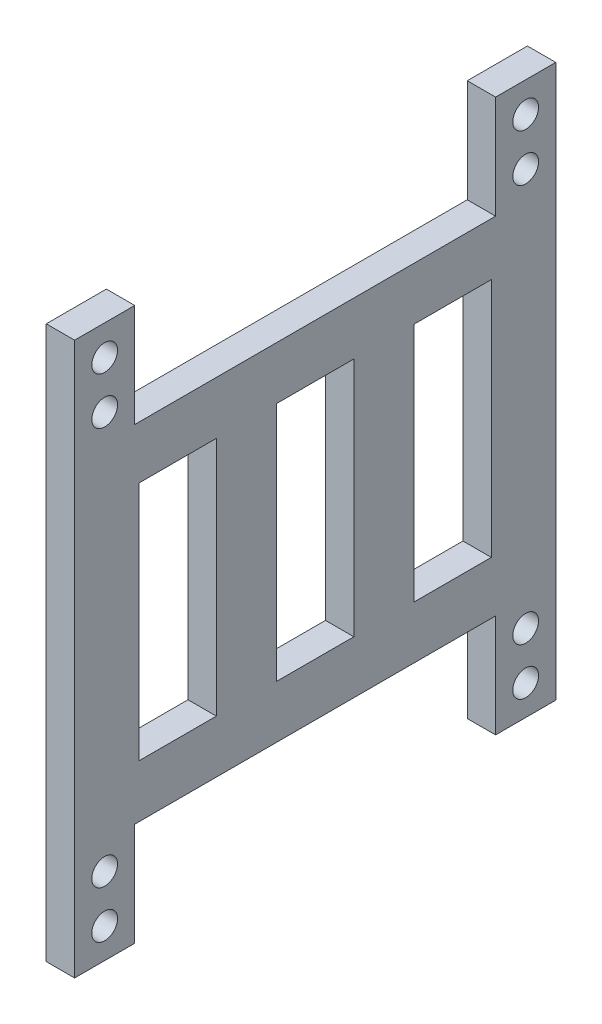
ISO-10303-21;
HEADER;
FILE_DESCRIPTION(('STEP AP214'),'2;1');
FILE_NAME('part.step','',(''),(''),'','','');
FILE_SCHEMA(('AUTOMOTIVE_DESIGN { 1 0 10303 214 1 1 1 1 }'));
ENDSEC;
DATA;
#1=APPLICATION_CONTEXT('core data for automotive mechanical design processes');
#2=APPLICATION_PROTOCOL_DEFINITION('international standard','automotive_design',2000,#1);
#3=PRODUCT_CONTEXT('',#1,'mechanical');
#4=PRODUCT('Part','Part','',(#3));
#5=PRODUCT_RELATED_PRODUCT_CATEGORY('part','',(#4));
#6=PRODUCT_DEFINITION_FORMATION('','',#4);
#7=PRODUCT_DEFINITION_CONTEXT('part definition',#1,'design');
#8=PRODUCT_DEFINITION('design','',#6,#7);
#9=PRODUCT_DEFINITION_SHAPE('','',#8);
#10=(LENGTH_UNIT() NAMED_UNIT(*) SI_UNIT(.MILLI.,.METRE.));
#11=(NAMED_UNIT(*) PLANE_ANGLE_UNIT() SI_UNIT($,.RADIAN.));
#12=(NAMED_UNIT(*) SI_UNIT($,.STERADIAN.) SOLID_ANGLE_UNIT());
#13=UNCERTAINTY_MEASURE_WITH_UNIT(LENGTH_MEASURE(1.E-05),#10,'distance_accuracy_value','');
#14=(GEOMETRIC_REPRESENTATION_CONTEXT(3) GLOBAL_UNCERTAINTY_ASSIGNED_CONTEXT((#13)) GLOBAL_UNIT_ASSIGNED_CONTEXT((#10,
#11,#12)) REPRESENTATION_CONTEXT('',''));
#15=CARTESIAN_POINT('',(0.,0.,0.));
#16=DIRECTION('',(0.,0.,1.));
#17=DIRECTION('',(1.,0.,0.));
#18=AXIS2_PLACEMENT_3D('',#15,#16,#17);
#19=CARTESIAN_POINT('',(3.3,-20.145,0.));
#20=DIRECTION('',(0.,1.,0.));
#21=DIRECTION('',(0.,0.,1.));
#22=AXIS2_PLACEMENT_3D('',#19,#20,#21);
#23=PLANE('',#22);
#24=DIRECTION('',(0.,0.,-1.));
#25=VECTOR('',#24,1.);
#26=CARTESIAN_POINT('',(0.,-20.145,0.));
#27=LINE('',#26,#25);
#28=CARTESIAN_POINT('',(0.,-20.145,21.));
#29=VERTEX_POINT('',#28);
#30=CARTESIAN_POINT('',(0.,-20.145,-21.));
#31=VERTEX_POINT('',#30);
#32=EDGE_CURVE('E264',#29,#31,#27,.T.);
#33=ORIENTED_EDGE('',*,*,#32,.T.);
#34=DIRECTION('',(-1.,0.,0.));
#35=VECTOR('',#34,1.);
#36=CARTESIAN_POINT('',(3.3,-20.145,-21.));
#37=LINE('',#36,#35);
#38=CARTESIAN_POINT('',(3.3,-20.145,-21.));
#39=VERTEX_POINT('',#38);
#40=EDGE_CURVE('E407',#39,#31,#37,.T.);
#41=ORIENTED_EDGE('',*,*,#40,.F.);
#42=DIRECTION('',(0.,0.,-1.));
#43=VECTOR('',#42,1.);
#44=CARTESIAN_POINT('',(3.3,-20.145,0.));
#45=LINE('',#44,#43);
#46=CARTESIAN_POINT('',(3.3,-20.145,21.));
#47=VERTEX_POINT('',#46);
#48=EDGE_CURVE('E271',#47,#39,#45,.T.);
#49=ORIENTED_EDGE('',*,*,#48,.F.);
#50=DIRECTION('',(-1.,0.,0.));
#51=VECTOR('',#50,1.);
#52=CARTESIAN_POINT('',(3.3,-20.145,21.));
#53=LINE('',#52,#51);
#54=EDGE_CURVE('E327',#47,#29,#53,.T.);
#55=ORIENTED_EDGE('',*,*,#54,.T.);
#56=EDGE_LOOP('',(#33,#41,#49,#55));
#57=FACE_BOUND('',#56,.T.);
#58=ADVANCED_FACE('F39',(#57),#23,.F.);
#59=CARTESIAN_POINT('',(3.3,0.,-21.));
#60=DIRECTION('',(0.,0.,-1.));
#61=DIRECTION('',(-1.,0.,0.));
#62=AXIS2_PLACEMENT_3D('',#59,#60,#61);
#63=PLANE('',#62);
#64=DIRECTION('',(0.,-1.,0.));
#65=VECTOR('',#64,1.);
#66=CARTESIAN_POINT('',(0.,0.,-21.));
#67=LINE('',#66,#65);
#68=CARTESIAN_POINT('',(0.,-32.145,-21.));
#69=VERTEX_POINT('',#68);
#70=EDGE_CURVE('E330',#31,#69,#67,.T.);
#71=ORIENTED_EDGE('',*,*,#70,.T.);
#72=DIRECTION('',(-1.,0.,0.));
#73=VECTOR('',#72,1.);
#74=CARTESIAN_POINT('',(3.3,-32.145,-21.));
#75=LINE('',#74,#73);
#76=CARTESIAN_POINT('',(3.3,-32.145,-21.));
#77=VERTEX_POINT('',#76);
#78=EDGE_CURVE('E405',#77,#69,#75,.T.);
#79=ORIENTED_EDGE('',*,*,#78,.F.);
#80=DIRECTION('',(0.,-1.,0.));
#81=VECTOR('',#80,1.);
#82=CARTESIAN_POINT('',(3.3,0.,-21.));
#83=LINE('',#82,#81);
#84=EDGE_CURVE('E274',#39,#77,#83,.T.);
#85=ORIENTED_EDGE('',*,*,#84,.F.);
#86=ORIENTED_EDGE('',*,*,#40,.T.);
#87=EDGE_LOOP('',(#71,#79,#85,#86));
#88=FACE_BOUND('',#87,.T.);
#89=ADVANCED_FACE('F465',(#88),#63,.F.);
#90=CARTESIAN_POINT('',(3.3,-32.145,0.));
#91=DIRECTION('',(0.,-1.,0.));
#92=DIRECTION('',(0.,0.,-1.));
#93=AXIS2_PLACEMENT_3D('',#90,#91,#92);
#94=PLANE('',#93);
#95=DIRECTION('',(0.,0.,1.));
#96=VECTOR('',#95,1.);
#97=CARTESIAN_POINT('',(0.,-32.145,0.));
#98=LINE('',#97,#96);
#99=CARTESIAN_POINT('',(0.,-32.145,-28.));
#100=VERTEX_POINT('',#99);
#101=EDGE_CURVE('E333',#100,#69,#98,.T.);
#102=ORIENTED_EDGE('',*,*,#101,.F.);
#103=DIRECTION('',(-1.,0.,0.));
#104=VECTOR('',#103,1.);
#105=CARTESIAN_POINT('',(3.3,-32.145,-28.));
#106=LINE('',#105,#104);
#107=CARTESIAN_POINT('',(3.3,-32.145,-28.));
#108=VERTEX_POINT('',#107);
#109=EDGE_CURVE('E403',#108,#100,#106,.T.);
#110=ORIENTED_EDGE('',*,*,#109,.F.);
#111=DIRECTION('',(0.,0.,1.));
#112=VECTOR('',#111,1.);
#113=CARTESIAN_POINT('',(3.3,-32.145,0.));
#114=LINE('',#113,#112);
#115=EDGE_CURVE('E277',#108,#77,#114,.T.);
#116=ORIENTED_EDGE('',*,*,#115,.T.);
#117=ORIENTED_EDGE('',*,*,#78,.T.);
#118=EDGE_LOOP('',(#102,#110,#116,#117));
#119=FACE_BOUND('',#118,.T.);
#120=ADVANCED_FACE('F470',(#119),#94,.T.);
#121=CARTESIAN_POINT('',(3.3,0.,-28.));
#122=DIRECTION('',(0.,0.,1.));
#123=DIRECTION('',(1.,0.,0.));
#124=AXIS2_PLACEMENT_3D('',#121,#122,#123);
#125=PLANE('',#124);
#126=DIRECTION('',(0.,1.,0.));
#127=VECTOR('',#126,1.);
#128=CARTESIAN_POINT('',(0.,0.,-28.));
#129=LINE('',#128,#127);
#130=CARTESIAN_POINT('',(0.,32.145,-28.));
#131=VERTEX_POINT('',#130);
#132=EDGE_CURVE('E336',#100,#131,#129,.T.);
#133=ORIENTED_EDGE('',*,*,#132,.T.);
#134=DIRECTION('',(-1.,0.,0.));
#135=VECTOR('',#134,1.);
#136=CARTESIAN_POINT('',(3.3,32.145,-28.));
#137=LINE('',#136,#135);
#138=CARTESIAN_POINT('',(3.3,32.145,-28.));
#139=VERTEX_POINT('',#138);
#140=EDGE_CURVE('E400',#139,#131,#137,.T.);
#141=ORIENTED_EDGE('',*,*,#140,.F.);
#142=DIRECTION('',(0.,1.,0.));
#143=VECTOR('',#142,1.);
#144=CARTESIAN_POINT('',(3.3,0.,-28.));
#145=LINE('',#144,#143);
#146=EDGE_CURVE('E280',#108,#139,#145,.T.);
#147=ORIENTED_EDGE('',*,*,#146,.F.);
#148=ORIENTED_EDGE('',*,*,#109,.T.);
#149=EDGE_LOOP('',(#133,#141,#147,#148));
#150=FACE_BOUND('',#149,.T.);
#151=ADVANCED_FACE('F516',(#150),#125,.F.);
#152=CARTESIAN_POINT('',(3.3,32.145,0.));
#153=DIRECTION('',(0.,-1.,0.));
#154=DIRECTION('',(0.,0.,-1.));
#155=AXIS2_PLACEMENT_3D('',#152,#153,#154);
#156=PLANE('',#155);
#157=DIRECTION('',(0.,0.,1.));
#158=VECTOR('',#157,1.);
#159=CARTESIAN_POINT('',(0.,32.145,0.));
#160=LINE('',#159,#158);
#161=CARTESIAN_POINT('',(0.,32.145,-21.));
#162=VERTEX_POINT('',#161);
#163=EDGE_CURVE('E338',#131,#162,#160,.T.);
#164=ORIENTED_EDGE('',*,*,#163,.T.);
#165=DIRECTION('',(-1.,0.,0.));
#166=VECTOR('',#165,1.);
#167=CARTESIAN_POINT('',(3.3,32.145,-21.));
#168=LINE('',#167,#166);
#169=CARTESIAN_POINT('',(3.3,32.145,-21.));
#170=VERTEX_POINT('',#169);
#171=EDGE_CURVE('E398',#170,#162,#168,.T.);
#172=ORIENTED_EDGE('',*,*,#171,.F.);
#173=DIRECTION('',(0.,0.,1.));
#174=VECTOR('',#173,1.);
#175=CARTESIAN_POINT('',(3.3,32.145,0.));
#176=LINE('',#175,#174);
#177=EDGE_CURVE('E282',#139,#170,#176,.T.);
#178=ORIENTED_EDGE('',*,*,#177,.F.);
#179=ORIENTED_EDGE('',*,*,#140,.T.);
#180=EDGE_LOOP('',(#164,#172,#178,#179));
#181=FACE_BOUND('',#180,.T.);
#182=ADVANCED_FACE('F511',(#181),#156,.F.);
#183=CARTESIAN_POINT('',(3.3,0.,-21.));
#184=DIRECTION('',(0.,0.,1.));
#185=DIRECTION('',(1.,0.,0.));
#186=AXIS2_PLACEMENT_3D('',#183,#184,#185);
#187=PLANE('',#186);
#188=DIRECTION('',(0.,1.,0.));
#189=VECTOR('',#188,1.);
#190=CARTESIAN_POINT('',(0.,0.,-21.));
#191=LINE('',#190,#189);
#192=CARTESIAN_POINT('',(0.,20.145,-21.));
#193=VERTEX_POINT('',#192);
#194=EDGE_CURVE('E341',#193,#162,#191,.T.);
#195=ORIENTED_EDGE('',*,*,#194,.F.);
#196=DIRECTION('',(-1.,0.,0.));
#197=VECTOR('',#196,1.);
#198=CARTESIAN_POINT('',(3.3,20.145,-21.));
#199=LINE('',#198,#197);
#200=CARTESIAN_POINT('',(3.3,20.145,-21.));
#201=VERTEX_POINT('',#200);
#202=EDGE_CURVE('E396',#201,#193,#199,.T.);
#203=ORIENTED_EDGE('',*,*,#202,.F.);
#204=DIRECTION('',(0.,1.,0.));
#205=VECTOR('',#204,1.);
#206=CARTESIAN_POINT('',(3.3,0.,-21.));
#207=LINE('',#206,#205);
#208=EDGE_CURVE('E284',#201,#170,#207,.T.);
#209=ORIENTED_EDGE('',*,*,#208,.T.);
#210=ORIENTED_EDGE('',*,*,#171,.T.);
#211=EDGE_LOOP('',(#195,#203,#209,#210));
#212=FACE_BOUND('',#211,.T.);
#213=ADVANCED_FACE('F505',(#212),#187,.T.);
#214=CARTESIAN_POINT('',(3.3,20.145,0.));
#215=DIRECTION('',(0.,1.,0.));
#216=DIRECTION('',(0.,0.,1.));
#217=AXIS2_PLACEMENT_3D('',#214,#215,#216);
#218=PLANE('',#217);
#219=DIRECTION('',(0.,0.,-1.));
#220=VECTOR('',#219,1.);
#221=CARTESIAN_POINT('',(0.,20.145,0.));
#222=LINE('',#221,#220);
#223=CARTESIAN_POINT('',(0.,20.145,21.));
#224=VERTEX_POINT('',#223);
#225=EDGE_CURVE('E344',#224,#193,#222,.T.);
#226=ORIENTED_EDGE('',*,*,#225,.F.);
#227=DIRECTION('',(-1.,0.,0.));
#228=VECTOR('',#227,1.);
#229=CARTESIAN_POINT('',(3.3,20.145,21.));
#230=LINE('',#229,#228);
#231=CARTESIAN_POINT('',(3.3,20.145,21.));
#232=VERTEX_POINT('',#231);
#233=EDGE_CURVE('E394',#232,#224,#230,.T.);
#234=ORIENTED_EDGE('',*,*,#233,.F.);
#235=DIRECTION('',(0.,0.,-1.));
#236=VECTOR('',#235,1.);
#237=CARTESIAN_POINT('',(3.3,20.145,0.));
#238=LINE('',#237,#236);
#239=EDGE_CURVE('E287',#232,#201,#238,.T.);
#240=ORIENTED_EDGE('',*,*,#239,.T.);
#241=ORIENTED_EDGE('',*,*,#202,.T.);
#242=EDGE_LOOP('',(#226,#234,#240,#241));
#243=FACE_BOUND('',#242,.T.);
#244=ADVANCED_FACE('F499',(#243),#218,.T.);
#245=CARTESIAN_POINT('',(3.3,0.,21.));
#246=DIRECTION('',(0.,0.,1.));
#247=DIRECTION('',(1.,0.,0.));
#248=AXIS2_PLACEMENT_3D('',#245,#246,#247);
#249=PLANE('',#248);
#250=DIRECTION('',(0.,1.,0.));
#251=VECTOR('',#250,1.);
#252=CARTESIAN_POINT('',(0.,0.,21.));
#253=LINE('',#252,#251);
#254=CARTESIAN_POINT('',(0.,32.145,21.));
#255=VERTEX_POINT('',#254);
#256=EDGE_CURVE('E347',#224,#255,#253,.T.);
#257=ORIENTED_EDGE('',*,*,#256,.T.);
#258=DIRECTION('',(-1.,0.,0.));
#259=VECTOR('',#258,1.);
#260=CARTESIAN_POINT('',(3.3,32.145,21.));
#261=LINE('',#260,#259);
#262=CARTESIAN_POINT('',(3.3,32.145,21.));
#263=VERTEX_POINT('',#262);
#264=EDGE_CURVE('E392',#263,#255,#261,.T.);
#265=ORIENTED_EDGE('',*,*,#264,.F.);
#266=DIRECTION('',(0.,1.,0.));
#267=VECTOR('',#266,1.);
#268=CARTESIAN_POINT('',(3.3,0.,21.));
#269=LINE('',#268,#267);
#270=EDGE_CURVE('E290',#232,#263,#269,.T.);
#271=ORIENTED_EDGE('',*,*,#270,.F.);
#272=ORIENTED_EDGE('',*,*,#233,.T.);
#273=EDGE_LOOP('',(#257,#265,#271,#272));
#274=FACE_BOUND('',#273,.T.);
#275=ADVANCED_FACE('F522',(#274),#249,.F.);
#276=CARTESIAN_POINT('',(3.3,32.145,0.));
#277=DIRECTION('',(0.,1.,0.));
#278=DIRECTION('',(0.,0.,1.));
#279=AXIS2_PLACEMENT_3D('',#276,#277,#278);
#280=PLANE('',#279);
#281=DIRECTION('',(0.,0.,-1.));
#282=VECTOR('',#281,1.);
#283=CARTESIAN_POINT('',(0.,32.145,0.));
#284=LINE('',#283,#282);
#285=CARTESIAN_POINT('',(0.,32.145,28.));
#286=VERTEX_POINT('',#285);
#287=EDGE_CURVE('E350',#286,#255,#284,.T.);
#288=ORIENTED_EDGE('',*,*,#287,.F.);
#289=DIRECTION('',(-1.,0.,0.));
#290=VECTOR('',#289,1.);
#291=CARTESIAN_POINT('',(3.3,32.145,28.));
#292=LINE('',#291,#290);
#293=CARTESIAN_POINT('',(3.3,32.145,28.));
#294=VERTEX_POINT('',#293);
#295=EDGE_CURVE('E390',#294,#286,#292,.T.);
#296=ORIENTED_EDGE('',*,*,#295,.F.);
#297=DIRECTION('',(0.,0.,-1.));
#298=VECTOR('',#297,1.);
#299=CARTESIAN_POINT('',(3.3,32.145,0.));
#300=LINE('',#299,#298);
#301=EDGE_CURVE('E292',#294,#263,#300,.T.);
#302=ORIENTED_EDGE('',*,*,#301,.T.);
#303=ORIENTED_EDGE('',*,*,#264,.T.);
#304=EDGE_LOOP('',(#288,#296,#302,#303));
#305=FACE_BOUND('',#304,.T.);
#306=ADVANCED_FACE('F493',(#305),#280,.T.);
#307=CARTESIAN_POINT('',(3.3,0.,28.));
#308=DIRECTION('',(0.,0.,1.));
#309=DIRECTION('',(0.,-1.,0.));
#310=AXIS2_PLACEMENT_3D('',#307,#308,#309);
#311=PLANE('',#310);
#312=DIRECTION('',(0.,1.,0.));
#313=VECTOR('',#312,1.);
#314=CARTESIAN_POINT('',(0.,0.,28.));
#315=LINE('',#314,#313);
#316=CARTESIAN_POINT('',(0.,-32.145,28.));
#317=VERTEX_POINT('',#316);
#318=EDGE_CURVE('E353',#317,#286,#315,.T.);
#319=ORIENTED_EDGE('',*,*,#318,.F.);
#320=DIRECTION('',(-1.,0.,0.));
#321=VECTOR('',#320,1.);
#322=CARTESIAN_POINT('',(3.3,-32.145,28.));
#323=LINE('',#322,#321);
#324=CARTESIAN_POINT('',(3.3,-32.145,28.));
#325=VERTEX_POINT('',#324);
#326=EDGE_CURVE('E388',#325,#317,#323,.T.);
#327=ORIENTED_EDGE('',*,*,#326,.F.);
#328=DIRECTION('',(0.,1.,0.));
#329=VECTOR('',#328,1.);
#330=CARTESIAN_POINT('',(3.3,0.,28.));
#331=LINE('',#330,#329);
#332=EDGE_CURVE('E295',#325,#294,#331,.T.);
#333=ORIENTED_EDGE('',*,*,#332,.T.);
#334=ORIENTED_EDGE('',*,*,#295,.T.);
#335=EDGE_LOOP('',(#319,#327,#333,#334));
#336=FACE_BOUND('',#335,.T.);
#337=ADVANCED_FACE('F488',(#336),#311,.T.);
#338=CARTESIAN_POINT('',(3.3,-32.1450000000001,0.));
#339=DIRECTION('',(0.,1.,0.));
#340=DIRECTION('',(0.,0.,1.));
#341=AXIS2_PLACEMENT_3D('',#338,#339,#340);
#342=PLANE('',#341);
#343=DIRECTION('',(0.,0.,-1.));
#344=VECTOR('',#343,1.);
#345=CARTESIAN_POINT('',(0.,-32.1450000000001,0.));
#346=LINE('',#345,#344);
#347=CARTESIAN_POINT('',(0.,-32.145,21.));
#348=VERTEX_POINT('',#347);
#349=EDGE_CURVE('E356',#317,#348,#346,.T.);
#350=ORIENTED_EDGE('',*,*,#349,.T.);
#351=DIRECTION('',(-1.,0.,0.));
#352=VECTOR('',#351,1.);
#353=CARTESIAN_POINT('',(3.3,-32.145,21.));
#354=LINE('',#353,#352);
#355=CARTESIAN_POINT('',(3.3,-32.145,21.));
#356=VERTEX_POINT('',#355);
#357=EDGE_CURVE('E386',#356,#348,#354,.T.);
#358=ORIENTED_EDGE('',*,*,#357,.F.);
#359=DIRECTION('',(0.,0.,-1.));
#360=VECTOR('',#359,1.);
#361=CARTESIAN_POINT('',(3.3,-32.1450000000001,0.));
#362=LINE('',#361,#360);
#363=EDGE_CURVE('E298',#325,#356,#362,.T.);
#364=ORIENTED_EDGE('',*,*,#363,.F.);
#365=ORIENTED_EDGE('',*,*,#326,.T.);
#366=EDGE_LOOP('',(#350,#358,#364,#365));
#367=FACE_BOUND('',#366,.T.);
#368=ADVANCED_FACE('F485',(#367),#342,.F.);
#369=CARTESIAN_POINT('',(3.3,-28.645,-24.5));
#370=DIRECTION('',(-1.,0.,0.));
#371=DIRECTION('',(0.,0.,1.));
#372=AXIS2_PLACEMENT_3D('',#369,#370,#371);
#373=CYLINDRICAL_SURFACE('',#372,1.5);
#374=CARTESIAN_POINT('',(3.3,-28.645,-24.5));
#375=DIRECTION('',(1.,0.,0.));
#376=DIRECTION('',(0.,0.,-1.));
#377=AXIS2_PLACEMENT_3D('',#374,#375,#376);
#378=CIRCLE('',#377,1.5);
#379=CARTESIAN_POINT('',(3.3,-28.645,-26.));
#380=VERTEX_POINT('',#379);
#381=EDGE_CURVE('E321',#380,#380,#378,.T.);
#382=ORIENTED_EDGE('',*,*,#381,.T.);
#383=EDGE_LOOP('',(#382));
#384=FACE_BOUND('',#383,.T.);
#385=CARTESIAN_POINT('',(0.,-28.645,-24.5));
#386=DIRECTION('',(1.,0.,0.));
#387=DIRECTION('',(0.,0.,-1.));
#388=AXIS2_PLACEMENT_3D('',#385,#386,#387);
#389=CIRCLE('',#388,1.5);
#390=CARTESIAN_POINT('',(0.,-28.645,-26.));
#391=VERTEX_POINT('',#390);
#392=EDGE_CURVE('E380',#391,#391,#389,.T.);
#393=ORIENTED_EDGE('',*,*,#392,.F.);
#394=EDGE_LOOP('',(#393));
#395=FACE_BOUND('',#394,.T.);
#396=ADVANCED_FACE('F589',(#384,#395),#373,.F.);
#397=CARTESIAN_POINT('',(3.3,-28.645,24.5));
#398=DIRECTION('',(-1.,0.,0.));
#399=DIRECTION('',(0.,0.,1.));
#400=AXIS2_PLACEMENT_3D('',#397,#398,#399);
#401=CYLINDRICAL_SURFACE('',#400,1.5);
#402=CARTESIAN_POINT('',(3.3,-28.645,24.5));
#403=DIRECTION('',(1.,0.,0.));
#404=DIRECTION('',(0.,0.,-1.));
#405=AXIS2_PLACEMENT_3D('',#402,#403,#404);
#406=CIRCLE('',#405,1.5);
#407=CARTESIAN_POINT('',(3.3,-28.645,23.));
#408=VERTEX_POINT('',#407);
#409=EDGE_CURVE('E318',#408,#408,#406,.F.);
#410=ORIENTED_EDGE('',*,*,#409,.F.);
#411=EDGE_LOOP('',(#410));
#412=FACE_BOUND('',#411,.T.);
#413=CARTESIAN_POINT('',(0.,-28.645,24.5));
#414=DIRECTION('',(1.,0.,0.));
#415=DIRECTION('',(0.,0.,-1.));
#416=AXIS2_PLACEMENT_3D('',#413,#414,#415);
#417=CIRCLE('',#416,1.5);
#418=CARTESIAN_POINT('',(0.,-28.645,23.));
#419=VERTEX_POINT('',#418);
#420=EDGE_CURVE('E377',#419,#419,#417,.F.);
#421=ORIENTED_EDGE('',*,*,#420,.T.);
#422=EDGE_LOOP('',(#421));
#423=FACE_BOUND('',#422,.T.);
#424=ADVANCED_FACE('F598',(#412,#423),#401,.F.);
#425=CARTESIAN_POINT('',(3.3,-23.145,24.5));
#426=DIRECTION('',(-1.,0.,0.));
#427=DIRECTION('',(0.,0.,1.));
#428=AXIS2_PLACEMENT_3D('',#425,#426,#427);
#429=CYLINDRICAL_SURFACE('',#428,1.5);
#430=CARTESIAN_POINT('',(3.3,-23.145,24.5));
#431=DIRECTION('',(1.,0.,0.));
#432=DIRECTION('',(0.,0.,-1.));
#433=AXIS2_PLACEMENT_3D('',#430,#431,#432);
#434=CIRCLE('',#433,1.5);
#435=CARTESIAN_POINT('',(3.3,-23.145,23.));
#436=VERTEX_POINT('',#435);
#437=EDGE_CURVE('E315',#436,#436,#434,.F.);
#438=ORIENTED_EDGE('',*,*,#437,.F.);
#439=EDGE_LOOP('',(#438));
#440=FACE_BOUND('',#439,.T.);
#441=CARTESIAN_POINT('',(0.,-23.145,24.5));
#442=DIRECTION('',(1.,0.,0.));
#443=DIRECTION('',(0.,0.,-1.));
#444=AXIS2_PLACEMENT_3D('',#441,#442,#443);
#445=CIRCLE('',#444,1.5);
#446=CARTESIAN_POINT('',(0.,-23.145,23.));
#447=VERTEX_POINT('',#446);
#448=EDGE_CURVE('E374',#447,#447,#445,.F.);
#449=ORIENTED_EDGE('',*,*,#448,.T.);
#450=EDGE_LOOP('',(#449));
#451=FACE_BOUND('',#450,.T.);
#452=ADVANCED_FACE('F608',(#440,#451),#429,.F.);
#453=CARTESIAN_POINT('',(3.3,28.645,-24.5));
#454=DIRECTION('',(-1.,0.,0.));
#455=DIRECTION('',(0.,0.,1.));
#456=AXIS2_PLACEMENT_3D('',#453,#454,#455);
#457=CYLINDRICAL_SURFACE('',#456,1.5);
#458=CARTESIAN_POINT('',(3.3,28.645,-24.5));
#459=DIRECTION('',(1.,0.,0.));
#460=DIRECTION('',(0.,0.,-1.));
#461=AXIS2_PLACEMENT_3D('',#458,#459,#460);
#462=CIRCLE('',#461,1.5);
#463=CARTESIAN_POINT('',(3.3,28.645,-26.));
#464=VERTEX_POINT('',#463);
#465=EDGE_CURVE('E312',#464,#464,#462,.F.);
#466=ORIENTED_EDGE('',*,*,#465,.F.);
#467=EDGE_LOOP('',(#466));
#468=FACE_BOUND('',#467,.T.);
#469=CARTESIAN_POINT('',(0.,28.645,-24.5));
#470=DIRECTION('',(1.,0.,0.));
#471=DIRECTION('',(0.,0.,-1.));
#472=AXIS2_PLACEMENT_3D('',#469,#470,#471);
#473=CIRCLE('',#472,1.5);
#474=CARTESIAN_POINT('',(0.,28.645,-26.));
#475=VERTEX_POINT('',#474);
#476=EDGE_CURVE('E371',#475,#475,#473,.F.);
#477=ORIENTED_EDGE('',*,*,#476,.T.);
#478=EDGE_LOOP('',(#477));
#479=FACE_BOUND('',#478,.T.);
#480=ADVANCED_FACE('F618',(#468,#479),#457,.F.);
#481=CARTESIAN_POINT('',(3.3,23.145,-24.5));
#482=DIRECTION('',(-1.,0.,0.));
#483=DIRECTION('',(0.,0.,1.));
#484=AXIS2_PLACEMENT_3D('',#481,#482,#483);
#485=CYLINDRICAL_SURFACE('',#484,1.5);
#486=CARTESIAN_POINT('',(3.3,23.145,-24.5));
#487=DIRECTION('',(1.,0.,0.));
#488=DIRECTION('',(0.,0.,-1.));
#489=AXIS2_PLACEMENT_3D('',#486,#487,#488);
#490=CIRCLE('',#489,1.5);
#491=CARTESIAN_POINT('',(3.3,23.145,-26.));
#492=VERTEX_POINT('',#491);
#493=EDGE_CURVE('E309',#492,#492,#490,.F.);
#494=ORIENTED_EDGE('',*,*,#493,.F.);
#495=EDGE_LOOP('',(#494));
#496=FACE_BOUND('',#495,.T.);
#497=CARTESIAN_POINT('',(0.,23.145,-24.5));
#498=DIRECTION('',(1.,0.,0.));
#499=DIRECTION('',(0.,0.,-1.));
#500=AXIS2_PLACEMENT_3D('',#497,#498,#499);
#501=CIRCLE('',#500,1.5);
#502=CARTESIAN_POINT('',(0.,23.145,-26.));
#503=VERTEX_POINT('',#502);
#504=EDGE_CURVE('E368',#503,#503,#501,.F.);
#505=ORIENTED_EDGE('',*,*,#504,.T.);
#506=EDGE_LOOP('',(#505));
#507=FACE_BOUND('',#506,.T.);
#508=ADVANCED_FACE('F628',(#496,#507),#485,.F.);
#509=CARTESIAN_POINT('',(3.3,28.645,24.5));
#510=DIRECTION('',(-1.,0.,0.));
#511=DIRECTION('',(0.,0.,1.));
#512=AXIS2_PLACEMENT_3D('',#509,#510,#511);
#513=CYLINDRICAL_SURFACE('',#512,1.5);
#514=CARTESIAN_POINT('',(3.3,28.645,24.5));
#515=DIRECTION('',(1.,0.,0.));
#516=DIRECTION('',(0.,0.,-1.));
#517=AXIS2_PLACEMENT_3D('',#514,#515,#516);
#518=CIRCLE('',#517,1.5);
#519=CARTESIAN_POINT('',(3.3,28.645,23.));
#520=VERTEX_POINT('',#519);
#521=EDGE_CURVE('E306',#520,#520,#518,.T.);
#522=ORIENTED_EDGE('',*,*,#521,.T.);
#523=EDGE_LOOP('',(#522));
#524=FACE_BOUND('',#523,.T.);
#525=CARTESIAN_POINT('',(0.,28.645,24.5));
#526=DIRECTION('',(1.,0.,0.));
#527=DIRECTION('',(0.,0.,-1.));
#528=AXIS2_PLACEMENT_3D('',#525,#526,#527);
#529=CIRCLE('',#528,1.5);
#530=CARTESIAN_POINT('',(0.,28.645,23.));
#531=VERTEX_POINT('',#530);
#532=EDGE_CURVE('E365',#531,#531,#529,.T.);
#533=ORIENTED_EDGE('',*,*,#532,.F.);
#534=EDGE_LOOP('',(#533));
#535=FACE_BOUND('',#534,.T.);
#536=ADVANCED_FACE('F638',(#524,#535),#513,.F.);
#537=CARTESIAN_POINT('',(3.3,23.145,24.5));
#538=DIRECTION('',(-1.,0.,0.));
#539=DIRECTION('',(0.,0.,1.));
#540=AXIS2_PLACEMENT_3D('',#537,#538,#539);
#541=CYLINDRICAL_SURFACE('',#540,1.5);
#542=CARTESIAN_POINT('',(3.3,23.145,24.5));
#543=DIRECTION('',(1.,0.,0.));
#544=DIRECTION('',(0.,0.,-1.));
#545=AXIS2_PLACEMENT_3D('',#542,#543,#544);
#546=CIRCLE('',#545,1.5);
#547=CARTESIAN_POINT('',(3.3,23.145,23.));
#548=VERTEX_POINT('',#547);
#549=EDGE_CURVE('E303',#548,#548,#546,.T.);
#550=ORIENTED_EDGE('',*,*,#549,.T.);
#551=EDGE_LOOP('',(#550));
#552=FACE_BOUND('',#551,.T.);
#553=CARTESIAN_POINT('',(0.,23.145,24.5));
#554=DIRECTION('',(1.,0.,0.));
#555=DIRECTION('',(0.,0.,-1.));
#556=AXIS2_PLACEMENT_3D('',#553,#554,#555);
#557=CIRCLE('',#556,1.5);
#558=CARTESIAN_POINT('',(0.,23.145,23.));
#559=VERTEX_POINT('',#558);
#560=EDGE_CURVE('E362',#559,#559,#557,.T.);
#561=ORIENTED_EDGE('',*,*,#560,.F.);
#562=EDGE_LOOP('',(#561));
#563=FACE_BOUND('',#562,.T.);
#564=ADVANCED_FACE('F648',(#552,#563),#541,.F.);
#565=CARTESIAN_POINT('',(3.3,0.,21.));
#566=DIRECTION('',(0.,0.,-1.));
#567=DIRECTION('',(0.,1.,0.));
#568=AXIS2_PLACEMENT_3D('',#565,#566,#567);
#569=PLANE('',#568);
#570=DIRECTION('',(0.,-1.,0.));
#571=VECTOR('',#570,1.);
#572=CARTESIAN_POINT('',(0.,0.,21.));
#573=LINE('',#572,#571);
#574=EDGE_CURVE('E359',#29,#348,#573,.T.);
#575=ORIENTED_EDGE('',*,*,#574,.F.);
#576=ORIENTED_EDGE('',*,*,#54,.F.);
#577=DIRECTION('',(0.,-1.,0.));
#578=VECTOR('',#577,1.);
#579=CARTESIAN_POINT('',(3.3,0.,21.));
#580=LINE('',#579,#578);
#581=EDGE_CURVE('E300',#47,#356,#580,.T.);
#582=ORIENTED_EDGE('',*,*,#581,.T.);
#583=ORIENTED_EDGE('',*,*,#357,.T.);
#584=EDGE_LOOP('',(#575,#576,#582,#583));
#585=FACE_BOUND('',#584,.T.);
#586=ADVANCED_FACE('F480',(#585),#569,.T.);
#587=CARTESIAN_POINT('',(3.3,-23.145,-24.5));
#588=DIRECTION('',(-1.,0.,0.));
#589=DIRECTION('',(0.,0.,1.));
#590=AXIS2_PLACEMENT_3D('',#587,#588,#589);
#591=CYLINDRICAL_SURFACE('',#590,1.5);
#592=CARTESIAN_POINT('',(3.3,-23.145,-24.5));
#593=DIRECTION('',(1.,0.,0.));
#594=DIRECTION('',(0.,0.,-1.));
#595=AXIS2_PLACEMENT_3D('',#592,#593,#594);
#596=CIRCLE('',#595,1.5);
#597=CARTESIAN_POINT('',(3.3,-23.145,-26.));
#598=VERTEX_POINT('',#597);
#599=EDGE_CURVE('E324',#598,#598,#596,.T.);
#600=ORIENTED_EDGE('',*,*,#599,.T.);
#601=EDGE_LOOP('',(#600));
#602=FACE_BOUND('',#601,.T.);
#603=CARTESIAN_POINT('',(0.,-23.145,-24.5));
#604=DIRECTION('',(1.,0.,0.));
#605=DIRECTION('',(0.,0.,-1.));
#606=AXIS2_PLACEMENT_3D('',#603,#604,#605);
#607=CIRCLE('',#606,1.5);
#608=CARTESIAN_POINT('',(0.,-23.145,-26.));
#609=VERTEX_POINT('',#608);
#610=EDGE_CURVE('E275',#609,#609,#607,.T.);
#611=ORIENTED_EDGE('',*,*,#610,.F.);
#612=EDGE_LOOP('',(#611));
#613=FACE_BOUND('',#612,.T.);
#614=ADVANCED_FACE('F667',(#602,#613),#591,.F.);
#615=CARTESIAN_POINT('',(3.3,0.,0.));
#616=DIRECTION('',(1.,0.,0.));
#617=DIRECTION('',(0.,0.,-1.));
#618=AXIS2_PLACEMENT_3D('',#615,#616,#617);
#619=PLANE('',#618);
#620=DIRECTION('',(0.,1.,0.));
#621=VECTOR('',#620,1.);
#622=CARTESIAN_POINT('',(3.3,-14.,11.5));
#623=LINE('',#622,#621);
#624=CARTESIAN_POINT('',(3.3,-14.,11.5));
#625=VERTEX_POINT('',#624);
#626=CARTESIAN_POINT('',(3.3,14.,11.5));
#627=VERTEX_POINT('',#626);
#628=EDGE_CURVE('E53',#625,#627,#623,.T.);
#629=ORIENTED_EDGE('',*,*,#628,.F.);
#630=DIRECTION('',(0.,0.,-1.));
#631=VECTOR('',#630,1.);
#632=CARTESIAN_POINT('',(3.3,-14.,20.5));
#633=LINE('',#632,#631);
#634=CARTESIAN_POINT('',(3.3,-14.,20.5));
#635=VERTEX_POINT('',#634);
#636=EDGE_CURVE('E240',#635,#625,#633,.T.);
#637=ORIENTED_EDGE('',*,*,#636,.F.);
#638=DIRECTION('',(0.,-1.,0.));
#639=VECTOR('',#638,1.);
#640=CARTESIAN_POINT('',(3.3,-14.,20.5));
#641=LINE('',#640,#639);
#642=CARTESIAN_POINT('',(3.3,14.,20.5));
#643=VERTEX_POINT('',#642);
#644=EDGE_CURVE('E237',#643,#635,#641,.T.);
#645=ORIENTED_EDGE('',*,*,#644,.F.);
#646=DIRECTION('',(0.,0.,1.));
#647=VECTOR('',#646,1.);
#648=CARTESIAN_POINT('',(3.3,14.,20.5));
#649=LINE('',#648,#647);
#650=EDGE_CURVE('E234',#627,#643,#649,.T.);
#651=ORIENTED_EDGE('',*,*,#650,.F.);
#652=EDGE_LOOP('',(#629,#637,#645,#651));
#653=FACE_BOUND('',#652,.T.);
#654=DIRECTION('',(0.,1.,0.));
#655=VECTOR('',#654,1.);
#656=CARTESIAN_POINT('',(3.3,-14.,-20.5));
#657=LINE('',#656,#655);
#658=CARTESIAN_POINT('',(3.3,-14.,-20.5));
#659=VERTEX_POINT('',#658);
#660=CARTESIAN_POINT('',(3.3,14.,-20.5));
#661=VERTEX_POINT('',#660);
#662=EDGE_CURVE('E61',#659,#661,#657,.T.);
#663=ORIENTED_EDGE('',*,*,#662,.F.);
#664=DIRECTION('',(0.,0.,-1.));
#665=VECTOR('',#664,1.);
#666=CARTESIAN_POINT('',(3.3,-14.,-11.5));
#667=LINE('',#666,#665);
#668=CARTESIAN_POINT('',(3.3,-14.,-11.5));
#669=VERTEX_POINT('',#668);
#670=EDGE_CURVE('E223',#669,#659,#667,.T.);
#671=ORIENTED_EDGE('',*,*,#670,.F.);
#672=DIRECTION('',(0.,-1.,0.));
#673=VECTOR('',#672,1.);
#674=CARTESIAN_POINT('',(3.3,-14.,-11.5));
#675=LINE('',#674,#673);
#676=CARTESIAN_POINT('',(3.3,14.,-11.5));
#677=VERTEX_POINT('',#676);
#678=EDGE_CURVE('E206',#677,#669,#675,.T.);
#679=ORIENTED_EDGE('',*,*,#678,.F.);
#680=DIRECTION('',(0.,0.,1.));
#681=VECTOR('',#680,1.);
#682=CARTESIAN_POINT('',(3.3,14.,-11.5));
#683=LINE('',#682,#681);
#684=EDGE_CURVE('E216',#661,#677,#683,.T.);
#685=ORIENTED_EDGE('',*,*,#684,.F.);
#686=EDGE_LOOP('',(#663,#671,#679,#685));
#687=FACE_BOUND('',#686,.T.);
#688=DIRECTION('',(0.,1.,0.));
#689=VECTOR('',#688,1.);
#690=CARTESIAN_POINT('',(3.3,-14.,-4.5));
#691=LINE('',#690,#689);
#692=CARTESIAN_POINT('',(3.3,-14.,-4.5));
#693=VERTEX_POINT('',#692);
#694=CARTESIAN_POINT('',(3.3,14.,-4.5));
#695=VERTEX_POINT('',#694);
#696=EDGE_CURVE('E230',#693,#695,#691,.T.);
#697=ORIENTED_EDGE('',*,*,#696,.F.);
#698=DIRECTION('',(0.,0.,-1.));
#699=VECTOR('',#698,1.);
#700=CARTESIAN_POINT('',(3.3,-14.,4.5));
#701=LINE('',#700,#699);
#702=CARTESIAN_POINT('',(3.3,-14.,4.5));
#703=VERTEX_POINT('',#702);
#704=EDGE_CURVE('E258',#703,#693,#701,.T.);
#705=ORIENTED_EDGE('',*,*,#704,.F.);
#706=DIRECTION('',(0.,-1.,0.));
#707=VECTOR('',#706,1.);
#708=CARTESIAN_POINT('',(3.3,-14.,4.5));
#709=LINE('',#708,#707);
#710=CARTESIAN_POINT('',(3.3,14.,4.5));
#711=VERTEX_POINT('',#710);
#712=EDGE_CURVE('E255',#711,#703,#709,.T.);
#713=ORIENTED_EDGE('',*,*,#712,.F.);
#714=DIRECTION('',(0.,0.,1.));
#715=VECTOR('',#714,1.);
#716=CARTESIAN_POINT('',(3.3,14.,4.5));
#717=LINE('',#716,#715);
#718=EDGE_CURVE('E252',#695,#711,#717,.T.);
#719=ORIENTED_EDGE('',*,*,#718,.F.);
#720=EDGE_LOOP('',(#697,#705,#713,#719));
#721=FACE_BOUND('',#720,.T.);
#722=ORIENTED_EDGE('',*,*,#48,.T.);
#723=ORIENTED_EDGE('',*,*,#84,.T.);
#724=ORIENTED_EDGE('',*,*,#115,.F.);
#725=ORIENTED_EDGE('',*,*,#146,.T.);
#726=ORIENTED_EDGE('',*,*,#177,.T.);
#727=ORIENTED_EDGE('',*,*,#208,.F.);
#728=ORIENTED_EDGE('',*,*,#239,.F.);
#729=ORIENTED_EDGE('',*,*,#270,.T.);
#730=ORIENTED_EDGE('',*,*,#301,.F.);
#731=ORIENTED_EDGE('',*,*,#332,.F.);
#732=ORIENTED_EDGE('',*,*,#363,.T.);
#733=ORIENTED_EDGE('',*,*,#581,.F.);
#734=EDGE_LOOP('',(#722,#723,#724,#725,#726,#727,#728,#729,#730,#731,#732,#733));
#735=FACE_BOUND('',#734,.T.);
#736=ORIENTED_EDGE('',*,*,#549,.F.);
#737=EDGE_LOOP('',(#736));
#738=FACE_BOUND('',#737,.T.);
#739=ORIENTED_EDGE('',*,*,#521,.F.);
#740=EDGE_LOOP('',(#739));
#741=FACE_BOUND('',#740,.T.);
#742=ORIENTED_EDGE('',*,*,#493,.T.);
#743=EDGE_LOOP('',(#742));
#744=FACE_BOUND('',#743,.T.);
#745=ORIENTED_EDGE('',*,*,#465,.T.);
#746=EDGE_LOOP('',(#745));
#747=FACE_BOUND('',#746,.T.);
#748=ORIENTED_EDGE('',*,*,#437,.T.);
#749=EDGE_LOOP('',(#748));
#750=FACE_BOUND('',#749,.T.);
#751=ORIENTED_EDGE('',*,*,#409,.T.);
#752=EDGE_LOOP('',(#751));
#753=FACE_BOUND('',#752,.T.);
#754=ORIENTED_EDGE('',*,*,#381,.F.);
#755=EDGE_LOOP('',(#754));
#756=FACE_BOUND('',#755,.T.);
#757=ORIENTED_EDGE('',*,*,#599,.F.);
#758=EDGE_LOOP('',(#757));
#759=FACE_BOUND('',#758,.T.);
#760=ADVANCED_FACE('F220',(#653,#687,#721,#735,#738,#741,#744,#747,#750,#753,#756,#759),#619,.T.);
#761=CARTESIAN_POINT('',(0.,0.,0.));
#762=DIRECTION('',(1.,0.,0.));
#763=DIRECTION('',(0.,0.,-1.));
#764=AXIS2_PLACEMENT_3D('',#761,#762,#763);
#765=PLANE('',#764);
#766=DIRECTION('',(0.,0.,-1.));
#767=VECTOR('',#766,1.);
#768=CARTESIAN_POINT('',(0.,-14.,0.));
#769=LINE('',#768,#767);
#770=CARTESIAN_POINT('',(0.,-14.,20.5));
#771=VERTEX_POINT('',#770);
#772=CARTESIAN_POINT('',(0.,-14.,11.5));
#773=VERTEX_POINT('',#772);
#774=EDGE_CURVE('E46',#771,#773,#769,.T.);
#775=ORIENTED_EDGE('',*,*,#774,.T.);
#776=DIRECTION('',(0.,1.,0.));
#777=VECTOR('',#776,1.);
#778=CARTESIAN_POINT('',(0.,0.,11.5));
#779=LINE('',#778,#777);
#780=CARTESIAN_POINT('',(0.,14.,11.5));
#781=VERTEX_POINT('',#780);
#782=EDGE_CURVE('E11',#773,#781,#779,.T.);
#783=ORIENTED_EDGE('',*,*,#782,.T.);
#784=DIRECTION('',(0.,0.,1.));
#785=VECTOR('',#784,1.);
#786=CARTESIAN_POINT('',(0.,14.,0.));
#787=LINE('',#786,#785);
#788=CARTESIAN_POINT('',(0.,14.,20.5));
#789=VERTEX_POINT('',#788);
#790=EDGE_CURVE('E431',#781,#789,#787,.T.);
#791=ORIENTED_EDGE('',*,*,#790,.T.);
#792=DIRECTION('',(0.,-1.,0.));
#793=VECTOR('',#792,1.);
#794=CARTESIAN_POINT('',(0.,0.,20.5));
#795=LINE('',#794,#793);
#796=EDGE_CURVE('E434',#789,#771,#795,.T.);
#797=ORIENTED_EDGE('',*,*,#796,.T.);
#798=EDGE_LOOP('',(#775,#783,#791,#797));
#799=FACE_BOUND('',#798,.T.);
#800=DIRECTION('',(0.,0.,-1.));
#801=VECTOR('',#800,1.);
#802=CARTESIAN_POINT('',(0.,-14.,0.));
#803=LINE('',#802,#801);
#804=CARTESIAN_POINT('',(0.,-14.,-11.5));
#805=VERTEX_POINT('',#804);
#806=CARTESIAN_POINT('',(0.,-14.,-20.5));
#807=VERTEX_POINT('',#806);
#808=EDGE_CURVE('E425',#805,#807,#803,.T.);
#809=ORIENTED_EDGE('',*,*,#808,.T.);
#810=DIRECTION('',(0.,1.,0.));
#811=VECTOR('',#810,1.);
#812=CARTESIAN_POINT('',(0.,0.,-20.5));
#813=LINE('',#812,#811);
#814=CARTESIAN_POINT('',(0.,14.,-20.5));
#815=VERTEX_POINT('',#814);
#816=EDGE_CURVE('E428',#807,#815,#813,.T.);
#817=ORIENTED_EDGE('',*,*,#816,.T.);
#818=DIRECTION('',(0.,0.,1.));
#819=VECTOR('',#818,1.);
#820=CARTESIAN_POINT('',(0.,14.,0.));
#821=LINE('',#820,#819);
#822=CARTESIAN_POINT('',(0.,14.,-11.5));
#823=VERTEX_POINT('',#822);
#824=EDGE_CURVE('E422',#815,#823,#821,.T.);
#825=ORIENTED_EDGE('',*,*,#824,.T.);
#826=DIRECTION('',(0.,-1.,0.));
#827=VECTOR('',#826,1.);
#828=CARTESIAN_POINT('',(0.,0.,-11.5));
#829=LINE('',#828,#827);
#830=EDGE_CURVE('E209',#823,#805,#829,.T.);
#831=ORIENTED_EDGE('',*,*,#830,.T.);
#832=EDGE_LOOP('',(#809,#817,#825,#831));
#833=FACE_BOUND('',#832,.T.);
#834=DIRECTION('',(0.,0.,-1.));
#835=VECTOR('',#834,1.);
#836=CARTESIAN_POINT('',(0.,-14.,0.));
#837=LINE('',#836,#835);
#838=CARTESIAN_POINT('',(0.,-14.,4.5));
#839=VERTEX_POINT('',#838);
#840=CARTESIAN_POINT('',(0.,-14.,-4.5));
#841=VERTEX_POINT('',#840);
#842=EDGE_CURVE('E416',#839,#841,#837,.T.);
#843=ORIENTED_EDGE('',*,*,#842,.T.);
#844=DIRECTION('',(0.,1.,0.));
#845=VECTOR('',#844,1.);
#846=CARTESIAN_POINT('',(0.,0.,-4.5));
#847=LINE('',#846,#845);
#848=CARTESIAN_POINT('',(0.,14.,-4.5));
#849=VERTEX_POINT('',#848);
#850=EDGE_CURVE('E419',#841,#849,#847,.T.);
#851=ORIENTED_EDGE('',*,*,#850,.T.);
#852=DIRECTION('',(0.,0.,1.));
#853=VECTOR('',#852,1.);
#854=CARTESIAN_POINT('',(0.,14.,0.));
#855=LINE('',#854,#853);
#856=CARTESIAN_POINT('',(0.,14.,4.5));
#857=VERTEX_POINT('',#856);
#858=EDGE_CURVE('E410',#849,#857,#855,.T.);
#859=ORIENTED_EDGE('',*,*,#858,.T.);
#860=DIRECTION('',(0.,-1.,0.));
#861=VECTOR('',#860,1.);
#862=CARTESIAN_POINT('',(0.,0.,4.5));
#863=LINE('',#862,#861);
#864=EDGE_CURVE('E413',#857,#839,#863,.T.);
#865=ORIENTED_EDGE('',*,*,#864,.T.);
#866=EDGE_LOOP('',(#843,#851,#859,#865));
#867=FACE_BOUND('',#866,.T.);
#868=ORIENTED_EDGE('',*,*,#32,.F.);
#869=ORIENTED_EDGE('',*,*,#574,.T.);
#870=ORIENTED_EDGE('',*,*,#349,.F.);
#871=ORIENTED_EDGE('',*,*,#318,.T.);
#872=ORIENTED_EDGE('',*,*,#287,.T.);
#873=ORIENTED_EDGE('',*,*,#256,.F.);
#874=ORIENTED_EDGE('',*,*,#225,.T.);
#875=ORIENTED_EDGE('',*,*,#194,.T.);
#876=ORIENTED_EDGE('',*,*,#163,.F.);
#877=ORIENTED_EDGE('',*,*,#132,.F.);
#878=ORIENTED_EDGE('',*,*,#101,.T.);
#879=ORIENTED_EDGE('',*,*,#70,.F.);
#880=EDGE_LOOP('',(#868,#869,#870,#871,#872,#873,#874,#875,#876,#877,#878,#879));
#881=FACE_BOUND('',#880,.T.);
#882=ORIENTED_EDGE('',*,*,#560,.T.);
#883=EDGE_LOOP('',(#882));
#884=FACE_BOUND('',#883,.T.);
#885=ORIENTED_EDGE('',*,*,#532,.T.);
#886=EDGE_LOOP('',(#885));
#887=FACE_BOUND('',#886,.T.);
#888=ORIENTED_EDGE('',*,*,#504,.F.);
#889=EDGE_LOOP('',(#888));
#890=FACE_BOUND('',#889,.T.);
#891=ORIENTED_EDGE('',*,*,#476,.F.);
#892=EDGE_LOOP('',(#891));
#893=FACE_BOUND('',#892,.T.);
#894=ORIENTED_EDGE('',*,*,#448,.F.);
#895=EDGE_LOOP('',(#894));
#896=FACE_BOUND('',#895,.T.);
#897=ORIENTED_EDGE('',*,*,#420,.F.);
#898=EDGE_LOOP('',(#897));
#899=FACE_BOUND('',#898,.T.);
#900=ORIENTED_EDGE('',*,*,#392,.T.);
#901=EDGE_LOOP('',(#900));
#902=FACE_BOUND('',#901,.T.);
#903=ORIENTED_EDGE('',*,*,#610,.T.);
#904=EDGE_LOOP('',(#903));
#905=FACE_BOUND('',#904,.T.);
#906=ADVANCED_FACE('F438',(#799,#833,#867,#881,#884,#887,#890,#893,#896,#899,#902,#905),#765,.F.);
#907=CARTESIAN_POINT('',(-6.7,-14.,-4.5));
#908=DIRECTION('',(0.,0.,-1.));
#909=DIRECTION('',(-1.,0.,0.));
#910=AXIS2_PLACEMENT_3D('',#907,#908,#909);
#911=PLANE('',#910);
#912=DIRECTION('',(1.,0.,0.));
#913=VECTOR('',#912,1.);
#914=CARTESIAN_POINT('',(-6.7,-14.,-4.5));
#915=LINE('',#914,#913);
#916=EDGE_CURVE('E262',#841,#693,#915,.T.);
#917=ORIENTED_EDGE('',*,*,#916,.T.);
#918=ORIENTED_EDGE('',*,*,#696,.T.);
#919=DIRECTION('',(1.,0.,0.));
#920=VECTOR('',#919,1.);
#921=CARTESIAN_POINT('',(-6.7,14.,-4.5));
#922=LINE('',#921,#920);
#923=EDGE_CURVE('E261',#849,#695,#922,.T.);
#924=ORIENTED_EDGE('',*,*,#923,.F.);
#925=ORIENTED_EDGE('',*,*,#850,.F.);
#926=EDGE_LOOP('',(#917,#918,#924,#925));
#927=FACE_BOUND('',#926,.T.);
#928=ADVANCED_FACE('F691',(#927),#911,.F.);
#929=CARTESIAN_POINT('',(-6.7,-14.,4.5));
#930=DIRECTION('',(0.,-1.,0.));
#931=DIRECTION('',(0.,0.,-1.));
#932=AXIS2_PLACEMENT_3D('',#929,#930,#931);
#933=PLANE('',#932);
#934=DIRECTION('',(1.,0.,0.));
#935=VECTOR('',#934,1.);
#936=CARTESIAN_POINT('',(-6.7,-14.,4.5));
#937=LINE('',#936,#935);
#938=EDGE_CURVE('E265',#839,#703,#937,.T.);
#939=ORIENTED_EDGE('',*,*,#938,.T.);
#940=ORIENTED_EDGE('',*,*,#704,.T.);
#941=ORIENTED_EDGE('',*,*,#916,.F.);
#942=ORIENTED_EDGE('',*,*,#842,.F.);
#943=EDGE_LOOP('',(#939,#940,#941,#942));
#944=FACE_BOUND('',#943,.T.);
#945=ADVANCED_FACE('F699',(#944),#933,.F.);
#946=CARTESIAN_POINT('',(-6.7,-14.,4.5));
#947=DIRECTION('',(0.,0.,1.));
#948=DIRECTION('',(1.,0.,0.));
#949=AXIS2_PLACEMENT_3D('',#946,#947,#948);
#950=PLANE('',#949);
#951=DIRECTION('',(1.,0.,0.));
#952=VECTOR('',#951,1.);
#953=CARTESIAN_POINT('',(-6.7,14.,4.5));
#954=LINE('',#953,#952);
#955=EDGE_CURVE('E267',#857,#711,#954,.T.);
#956=ORIENTED_EDGE('',*,*,#955,.T.);
#957=ORIENTED_EDGE('',*,*,#712,.T.);
#958=ORIENTED_EDGE('',*,*,#938,.F.);
#959=ORIENTED_EDGE('',*,*,#864,.F.);
#960=EDGE_LOOP('',(#956,#957,#958,#959));
#961=FACE_BOUND('',#960,.T.);
#962=ADVANCED_FACE('F709',(#961),#950,.F.);
#963=CARTESIAN_POINT('',(-6.7,14.,4.5));
#964=DIRECTION('',(0.,1.,0.));
#965=DIRECTION('',(0.,0.,1.));
#966=AXIS2_PLACEMENT_3D('',#963,#964,#965);
#967=PLANE('',#966);
#968=ORIENTED_EDGE('',*,*,#923,.T.);
#969=ORIENTED_EDGE('',*,*,#718,.T.);
#970=ORIENTED_EDGE('',*,*,#955,.F.);
#971=ORIENTED_EDGE('',*,*,#858,.F.);
#972=EDGE_LOOP('',(#968,#969,#970,#971));
#973=FACE_BOUND('',#972,.T.);
#974=ADVANCED_FACE('F718',(#973),#967,.F.);
#975=CARTESIAN_POINT('',(-6.7,-14.,-20.5));
#976=DIRECTION('',(0.,0.,-1.));
#977=DIRECTION('',(-1.,0.,0.));
#978=AXIS2_PLACEMENT_3D('',#975,#976,#977);
#979=PLANE('',#978);
#980=DIRECTION('',(1.,0.,0.));
#981=VECTOR('',#980,1.);
#982=CARTESIAN_POINT('',(-6.7,-14.,-20.5));
#983=LINE('',#982,#981);
#984=EDGE_CURVE('E228',#807,#659,#983,.T.);
#985=ORIENTED_EDGE('',*,*,#984,.T.);
#986=ORIENTED_EDGE('',*,*,#662,.T.);
#987=DIRECTION('',(1.,0.,0.));
#988=VECTOR('',#987,1.);
#989=CARTESIAN_POINT('',(-6.7,14.,-20.5));
#990=LINE('',#989,#988);
#991=EDGE_CURVE('E213',#815,#661,#990,.T.);
#992=ORIENTED_EDGE('',*,*,#991,.F.);
#993=ORIENTED_EDGE('',*,*,#816,.F.);
#994=EDGE_LOOP('',(#985,#986,#992,#993));
#995=FACE_BOUND('',#994,.T.);
#996=ADVANCED_FACE('F728',(#995),#979,.F.);
#997=CARTESIAN_POINT('',(-6.7,-14.,-11.5));
#998=DIRECTION('',(0.,-1.,0.));
#999=DIRECTION('',(0.,0.,-1.));
#1000=AXIS2_PLACEMENT_3D('',#997,#998,#999);
#1001=PLANE('',#1000);
#1002=DIRECTION('',(1.,0.,0.));
#1003=VECTOR('',#1002,1.);
#1004=CARTESIAN_POINT('',(-6.7,-14.,-11.5));
#1005=LINE('',#1004,#1003);
#1006=EDGE_CURVE('E212',#805,#669,#1005,.T.);
#1007=ORIENTED_EDGE('',*,*,#1006,.T.);
#1008=ORIENTED_EDGE('',*,*,#670,.T.);
#1009=ORIENTED_EDGE('',*,*,#984,.F.);
#1010=ORIENTED_EDGE('',*,*,#808,.F.);
#1011=EDGE_LOOP('',(#1007,#1008,#1009,#1010));
#1012=FACE_BOUND('',#1011,.T.);
#1013=ADVANCED_FACE('F738',(#1012),#1001,.F.);
#1014=CARTESIAN_POINT('',(-6.7,-14.,-11.5));
#1015=DIRECTION('',(0.,0.,1.));
#1016=DIRECTION('',(1.,0.,0.));
#1017=AXIS2_PLACEMENT_3D('',#1014,#1015,#1016);
#1018=PLANE('',#1017);
#1019=DIRECTION('',(1.,0.,0.));
#1020=VECTOR('',#1019,1.);
#1021=CARTESIAN_POINT('',(-6.7,14.,-11.5));
#1022=LINE('',#1021,#1020);
#1023=EDGE_CURVE('E201',#823,#677,#1022,.T.);
#1024=ORIENTED_EDGE('',*,*,#1023,.T.);
#1025=ORIENTED_EDGE('',*,*,#678,.T.);
#1026=ORIENTED_EDGE('',*,*,#1006,.F.);
#1027=ORIENTED_EDGE('',*,*,#830,.F.);
#1028=EDGE_LOOP('',(#1024,#1025,#1026,#1027));
#1029=FACE_BOUND('',#1028,.T.);
#1030=ADVANCED_FACE('F203',(#1029),#1018,.F.);
#1031=CARTESIAN_POINT('',(-6.7,14.,-11.5));
#1032=DIRECTION('',(0.,1.,0.));
#1033=DIRECTION('',(0.,0.,1.));
#1034=AXIS2_PLACEMENT_3D('',#1031,#1032,#1033);
#1035=PLANE('',#1034);
#1036=ORIENTED_EDGE('',*,*,#991,.T.);
#1037=ORIENTED_EDGE('',*,*,#684,.T.);
#1038=ORIENTED_EDGE('',*,*,#1023,.F.);
#1039=ORIENTED_EDGE('',*,*,#824,.F.);
#1040=EDGE_LOOP('',(#1036,#1037,#1038,#1039));
#1041=FACE_BOUND('',#1040,.T.);
#1042=ADVANCED_FACE('F217',(#1041),#1035,.F.);
#1043=CARTESIAN_POINT('',(-6.7,-14.,11.5));
#1044=DIRECTION('',(0.,0.,-1.));
#1045=DIRECTION('',(-1.,0.,0.));
#1046=AXIS2_PLACEMENT_3D('',#1043,#1044,#1045);
#1047=PLANE('',#1046);
#1048=DIRECTION('',(1.,0.,0.));
#1049=VECTOR('',#1048,1.);
#1050=CARTESIAN_POINT('',(-6.7,-14.,11.5));
#1051=LINE('',#1050,#1049);
#1052=EDGE_CURVE('E244',#773,#625,#1051,.T.);
#1053=ORIENTED_EDGE('',*,*,#1052,.T.);
#1054=ORIENTED_EDGE('',*,*,#628,.T.);
#1055=DIRECTION('',(1.,0.,0.));
#1056=VECTOR('',#1055,1.);
#1057=CARTESIAN_POINT('',(-6.7,14.,11.5));
#1058=LINE('',#1057,#1056);
#1059=EDGE_CURVE('E243',#781,#627,#1058,.T.);
#1060=ORIENTED_EDGE('',*,*,#1059,.F.);
#1061=ORIENTED_EDGE('',*,*,#782,.F.);
#1062=EDGE_LOOP('',(#1053,#1054,#1060,#1061));
#1063=FACE_BOUND('',#1062,.T.);
#1064=ADVANCED_FACE('F453',(#1063),#1047,.F.);
#1065=CARTESIAN_POINT('',(-6.7,-14.,20.5));
#1066=DIRECTION('',(0.,-1.,0.));
#1067=DIRECTION('',(0.,0.,-1.));
#1068=AXIS2_PLACEMENT_3D('',#1065,#1066,#1067);
#1069=PLANE('',#1068);
#1070=DIRECTION('',(1.,0.,0.));
#1071=VECTOR('',#1070,1.);
#1072=CARTESIAN_POINT('',(-6.7,-14.,20.5));
#1073=LINE('',#1072,#1071);
#1074=EDGE_CURVE('E246',#771,#635,#1073,.T.);
#1075=ORIENTED_EDGE('',*,*,#1074,.T.);
#1076=ORIENTED_EDGE('',*,*,#636,.T.);
#1077=ORIENTED_EDGE('',*,*,#1052,.F.);
#1078=ORIENTED_EDGE('',*,*,#774,.F.);
#1079=EDGE_LOOP('',(#1075,#1076,#1077,#1078));
#1080=FACE_BOUND('',#1079,.T.);
#1081=ADVANCED_FACE('F444',(#1080),#1069,.F.);
#1082=CARTESIAN_POINT('',(-6.7,-14.,20.5));
#1083=DIRECTION('',(0.,0.,1.));
#1084=DIRECTION('',(1.,0.,0.));
#1085=AXIS2_PLACEMENT_3D('',#1082,#1083,#1084);
#1086=PLANE('',#1085);
#1087=DIRECTION('',(1.,0.,0.));
#1088=VECTOR('',#1087,1.);
#1089=CARTESIAN_POINT('',(-6.7,14.,20.5));
#1090=LINE('',#1089,#1088);
#1091=EDGE_CURVE('E248',#789,#643,#1090,.T.);
#1092=ORIENTED_EDGE('',*,*,#1091,.T.);
#1093=ORIENTED_EDGE('',*,*,#644,.T.);
#1094=ORIENTED_EDGE('',*,*,#1074,.F.);
#1095=ORIENTED_EDGE('',*,*,#796,.F.);
#1096=EDGE_LOOP('',(#1092,#1093,#1094,#1095));
#1097=FACE_BOUND('',#1096,.T.);
#1098=ADVANCED_FACE('F446',(#1097),#1086,.F.);
#1099=CARTESIAN_POINT('',(-6.7,14.,20.5));
#1100=DIRECTION('',(0.,1.,0.));
#1101=DIRECTION('',(0.,0.,1.));
#1102=AXIS2_PLACEMENT_3D('',#1099,#1100,#1101);
#1103=PLANE('',#1102);
#1104=ORIENTED_EDGE('',*,*,#1059,.T.);
#1105=ORIENTED_EDGE('',*,*,#650,.T.);
#1106=ORIENTED_EDGE('',*,*,#1091,.F.);
#1107=ORIENTED_EDGE('',*,*,#790,.F.);
#1108=EDGE_LOOP('',(#1104,#1105,#1106,#1107));
#1109=FACE_BOUND('',#1108,.T.);
#1110=ADVANCED_FACE('F452',(#1109),#1103,.F.);
#1111=CLOSED_SHELL('',(#58,#89,#120,#151,#182,#213,#244,#275,#306,#337,#368,#396,#424,#452,#480,
#508,#536,#564,#586,#614,#760,#906,#928,#945,#962,#974,#996,#1013,#1030,#1042,#1064,#1081,#1098,#1110));
#1112=MANIFOLD_SOLID_BREP('B2',#1111);
#1113=ADVANCED_BREP_SHAPE_REPRESENTATION('',(#18,#1112),#14);
#1114=SHAPE_DEFINITION_REPRESENTATION(#9,#1113);
ENDSEC;
END-ISO-10303-21;
